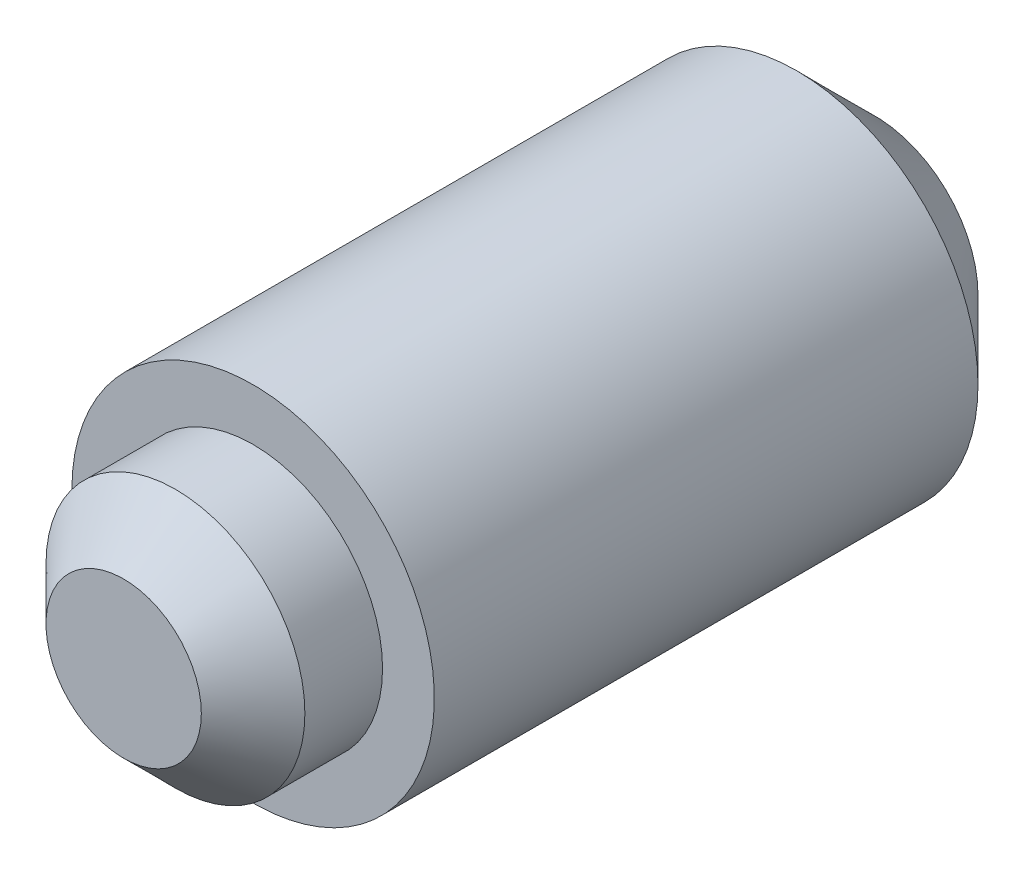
ISO-10303-21;
HEADER;
FILE_DESCRIPTION(('STEP AP214'),'2;1');
FILE_NAME('part.step','',(''),(''),'','','');
FILE_SCHEMA(('AUTOMOTIVE_DESIGN { 1 0 10303 214 1 1 1 1 }'));
ENDSEC;
DATA;
#1=APPLICATION_CONTEXT('core data for automotive mechanical design processes');
#2=APPLICATION_PROTOCOL_DEFINITION('international standard','automotive_design',2000,#1);
#3=PRODUCT_CONTEXT('',#1,'mechanical');
#4=PRODUCT('Part','Part','',(#3));
#5=PRODUCT_RELATED_PRODUCT_CATEGORY('part','',(#4));
#6=PRODUCT_DEFINITION_FORMATION('','',#4);
#7=PRODUCT_DEFINITION_CONTEXT('part definition',#1,'design');
#8=PRODUCT_DEFINITION('design','',#6,#7);
#9=PRODUCT_DEFINITION_SHAPE('','',#8);
#10=(LENGTH_UNIT() NAMED_UNIT(*) SI_UNIT(.MILLI.,.METRE.));
#11=(NAMED_UNIT(*) PLANE_ANGLE_UNIT() SI_UNIT($,.RADIAN.));
#12=(NAMED_UNIT(*) SI_UNIT($,.STERADIAN.) SOLID_ANGLE_UNIT());
#13=UNCERTAINTY_MEASURE_WITH_UNIT(LENGTH_MEASURE(1.E-05),#10,'distance_accuracy_value','');
#14=(GEOMETRIC_REPRESENTATION_CONTEXT(3) GLOBAL_UNCERTAINTY_ASSIGNED_CONTEXT((#13)) GLOBAL_UNIT_ASSIGNED_CONTEXT((#10,
#11,#12)) REPRESENTATION_CONTEXT('',''));
#15=CARTESIAN_POINT('',(0.,0.,0.));
#16=DIRECTION('',(0.,0.,1.));
#17=DIRECTION('',(1.,0.,0.));
#18=AXIS2_PLACEMENT_3D('',#15,#16,#17);
#19=CARTESIAN_POINT('',(0.,0.,14.5));
#20=DIRECTION('',(0.,0.,-1.));
#21=DIRECTION('',(-1.,0.,0.));
#22=AXIS2_PLACEMENT_3D('',#19,#20,#21);
#23=CYLINDRICAL_SURFACE('',#22,7.);
#24=CARTESIAN_POINT('',(0.,0.,-11.5));
#25=DIRECTION('',(0.,0.,1.));
#26=DIRECTION('',(1.,0.,0.));
#27=AXIS2_PLACEMENT_3D('',#24,#25,#26);
#28=CIRCLE('',#27,7.);
#29=CARTESIAN_POINT('',(-7.,0.,-11.5));
#30=VERTEX_POINT('',#29);
#31=EDGE_CURVE('E48',#30,#30,#28,.T.);
#32=CARTESIAN_POINT('',(0.,0.,9.5));
#33=DIRECTION('',(0.,0.,1.));
#34=DIRECTION('',(1.,0.,0.));
#35=AXIS2_PLACEMENT_3D('',#32,#33,#34);
#36=CIRCLE('',#35,7.);
#37=CARTESIAN_POINT('',(-7.,0.,9.5));
#38=VERTEX_POINT('',#37);
#39=EDGE_CURVE('E53',#38,#38,#36,.T.);
#40=CARTESIAN_POINT('',(-7.,0.,-11.5));
#41=CARTESIAN_POINT('',(-7.,0.,-11.28125));
#42=CARTESIAN_POINT('',(-7.,0.,-11.0625));
#43=CARTESIAN_POINT('',(-7.,0.,-10.625));
#44=CARTESIAN_POINT('',(-7.,0.,-10.40625));
#45=CARTESIAN_POINT('',(-7.,0.,-9.96874999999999));
#46=CARTESIAN_POINT('',(-7.,0.,-9.74999999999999));
#47=CARTESIAN_POINT('',(-7.,0.,-9.31249999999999));
#48=CARTESIAN_POINT('',(-7.,0.,-9.09374999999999));
#49=CARTESIAN_POINT('',(-7.,0.,-8.65624999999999));
#50=CARTESIAN_POINT('',(-7.,0.,-8.43749999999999));
#51=CARTESIAN_POINT('',(-7.,0.,-7.99999999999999));
#52=CARTESIAN_POINT('',(-7.,0.,-7.78124999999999));
#53=CARTESIAN_POINT('',(-7.,0.,-7.34374999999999));
#54=CARTESIAN_POINT('',(-7.,0.,-7.12499999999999));
#55=CARTESIAN_POINT('',(-7.,0.,-6.68749999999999));
#56=CARTESIAN_POINT('',(-7.,0.,-6.46874999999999));
#57=CARTESIAN_POINT('',(-7.,0.,-6.03124999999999));
#58=CARTESIAN_POINT('',(-7.,0.,-5.81249999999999));
#59=CARTESIAN_POINT('',(-7.,0.,-5.37499999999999));
#60=CARTESIAN_POINT('',(-7.,0.,-5.15624999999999));
#61=CARTESIAN_POINT('',(-7.,0.,-4.71874999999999));
#62=CARTESIAN_POINT('',(-7.,0.,-4.49999999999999));
#63=CARTESIAN_POINT('',(-7.,0.,-4.06249999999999));
#64=CARTESIAN_POINT('',(-7.,0.,-3.84374999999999));
#65=CARTESIAN_POINT('',(-7.,0.,-3.40624999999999));
#66=CARTESIAN_POINT('',(-7.,0.,-3.18749999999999));
#67=CARTESIAN_POINT('',(-7.,0.,-2.74999999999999));
#68=CARTESIAN_POINT('',(-7.,0.,-2.53124999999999));
#69=CARTESIAN_POINT('',(-7.,0.,-2.09374999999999));
#70=CARTESIAN_POINT('',(-7.,0.,-1.87499999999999));
#71=CARTESIAN_POINT('',(-7.,0.,-1.43749999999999));
#72=CARTESIAN_POINT('',(-7.,0.,-1.21874999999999));
#73=CARTESIAN_POINT('',(-7.,0.,-0.781249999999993));
#74=CARTESIAN_POINT('',(-7.,0.,-0.562499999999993));
#75=CARTESIAN_POINT('',(-7.,0.,-0.124999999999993));
#76=CARTESIAN_POINT('',(-7.,0.,0.093750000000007));
#77=CARTESIAN_POINT('',(-7.,0.,0.531250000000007));
#78=CARTESIAN_POINT('',(-7.,0.,0.750000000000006));
#79=CARTESIAN_POINT('',(-7.,0.,1.18750000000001));
#80=CARTESIAN_POINT('',(-7.,0.,1.40625000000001));
#81=CARTESIAN_POINT('',(-7.,0.,1.84375000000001));
#82=CARTESIAN_POINT('',(-7.,0.,2.06250000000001));
#83=CARTESIAN_POINT('',(-7.,0.,2.50000000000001));
#84=CARTESIAN_POINT('',(-7.,0.,2.71875000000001));
#85=CARTESIAN_POINT('',(-7.,0.,3.15625000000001));
#86=CARTESIAN_POINT('',(-7.,0.,3.37500000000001));
#87=CARTESIAN_POINT('',(-7.,0.,3.8125));
#88=CARTESIAN_POINT('',(-7.,0.,4.03125));
#89=CARTESIAN_POINT('',(-7.,0.,4.46875));
#90=CARTESIAN_POINT('',(-7.,0.,4.6875));
#91=CARTESIAN_POINT('',(-7.,0.,5.125));
#92=CARTESIAN_POINT('',(-7.,0.,5.34375));
#93=CARTESIAN_POINT('',(-7.,0.,5.78125));
#94=CARTESIAN_POINT('',(-7.,0.,6.));
#95=CARTESIAN_POINT('',(-7.,0.,6.4375));
#96=CARTESIAN_POINT('',(-7.,0.,6.65625));
#97=CARTESIAN_POINT('',(-7.,0.,7.09375));
#98=CARTESIAN_POINT('',(-7.,0.,7.3125));
#99=CARTESIAN_POINT('',(-7.,0.,7.75));
#100=CARTESIAN_POINT('',(-7.,0.,7.96875));
#101=CARTESIAN_POINT('',(-7.,0.,8.40625));
#102=CARTESIAN_POINT('',(-7.,0.,8.625));
#103=CARTESIAN_POINT('',(-7.,0.,9.0625));
#104=CARTESIAN_POINT('',(-7.,0.,9.28125));
#105=CARTESIAN_POINT('',(-7.,0.,9.5));
#106=B_SPLINE_CURVE_WITH_KNOTS('',3,(#40,#41,#42,#43,#44,#45,#46,#47,#48,#49,#50,#51,#52,#53,
#54,#55,#56,#57,#58,#59,#60,#61,#62,#63,#64,#65,#66,#67,#68,#69,#70,#71,#72,#73,#74,#75,#76,#77,
#78,#79,#80,#81,#82,#83,#84,#85,#86,#87,#88,#89,#90,#91,#92,#93,#94,#95,#96,#97,#98,#99,#100,
#101,#102,#103,#104,#105),.UNSPECIFIED.,.F.,.F.,(4,2,2,2,2,2,2,2,2,2,2,2,2,2,2,2,2,2,2,2,2,2,2,
2,2,2,2,2,2,2,2,2,4),(0.,0.656250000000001,1.3125,1.96875,2.625,3.28125,3.9375,4.59375,5.25,
5.90624999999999,6.5625,7.21875,7.87499999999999,8.53125,9.18749999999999,9.84374999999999,10.5,
11.15625,11.8125,12.46875,13.125,13.78125,14.4375,15.09375,15.75,16.40625,17.0625,17.71875,
18.375,19.03125,19.6875,20.34375,21.),.UNSPECIFIED.);
#107=EDGE_CURVE('BSEAM33',#30,#38,#106,.T.);
#108=ORIENTED_EDGE('',*,*,#31,.T.);
#109=ORIENTED_EDGE('',*,*,#39,.F.);
#110=ORIENTED_EDGE('',*,*,#107,.T.);
#111=ORIENTED_EDGE('',*,*,#107,.F.);
#112=EDGE_LOOP('',(#108,#110,#109,#111));
#113=FACE_BOUND('',#112,.T.);
#114=ADVANCED_FACE('F33',(#113),#23,.T.);
#115=CARTESIAN_POINT('',(0.,0.,-14.5));
#116=DIRECTION('',(0.,0.,1.));
#117=DIRECTION('',(1.,0.,0.));
#118=AXIS2_PLACEMENT_3D('',#115,#116,#117);
#119=PLANE('',#118);
#120=CARTESIAN_POINT('',(0.,0.,-14.5));
#121=DIRECTION('',(0.,0.,1.));
#122=DIRECTION('',(1.,0.,0.));
#123=AXIS2_PLACEMENT_3D('',#120,#121,#122);
#124=CIRCLE('',#123,3.99999999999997);
#125=CARTESIAN_POINT('',(3.99999999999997,0.,-14.5));
#126=VERTEX_POINT('',#125);
#127=EDGE_CURVE('E44',#126,#126,#124,.F.);
#128=ORIENTED_EDGE('',*,*,#127,.T.);
#129=EDGE_LOOP('',(#128));
#130=FACE_BOUND('',#129,.T.);
#131=ADVANCED_FACE('F65',(#130),#119,.F.);
#132=CARTESIAN_POINT('',(0.,0.,9.5));
#133=DIRECTION('',(0.,0.,1.));
#134=DIRECTION('',(1.,0.,0.));
#135=AXIS2_PLACEMENT_3D('',#132,#133,#134);
#136=PLANE('',#135);
#137=CARTESIAN_POINT('',(0.,0.,9.5));
#138=DIRECTION('',(0.,0.,1.));
#139=DIRECTION('',(1.,0.,0.));
#140=AXIS2_PLACEMENT_3D('',#137,#138,#139);
#141=CIRCLE('',#140,5.);
#142=CARTESIAN_POINT('',(5.,0.,9.5));
#143=VERTEX_POINT('',#142);
#144=EDGE_CURVE('E56',#143,#143,#141,.T.);
#145=ORIENTED_EDGE('',*,*,#144,.F.);
#146=EDGE_LOOP('',(#145));
#147=FACE_BOUND('',#146,.T.);
#148=ORIENTED_EDGE('',*,*,#39,.T.);
#149=EDGE_LOOP('',(#148));
#150=FACE_BOUND('',#149,.T.);
#151=ADVANCED_FACE('F62',(#147,#150),#136,.T.);
#152=CARTESIAN_POINT('',(0.,0.,9.5));
#153=DIRECTION('',(0.,0.,1.));
#154=DIRECTION('',(1.,0.,0.));
#155=AXIS2_PLACEMENT_3D('',#152,#153,#154);
#156=CYLINDRICAL_SURFACE('',#155,5.);
#157=CARTESIAN_POINT('',(0.,0.,12.5));
#158=DIRECTION('',(0.,0.,1.));
#159=DIRECTION('',(1.,0.,0.));
#160=AXIS2_PLACEMENT_3D('',#157,#158,#159);
#161=CIRCLE('',#160,5.);
#162=CARTESIAN_POINT('',(5.,0.,12.5));
#163=VERTEX_POINT('',#162);
#164=EDGE_CURVE('E11',#163,#163,#161,.F.);
#165=ORIENTED_EDGE('',*,*,#164,.T.);
#166=EDGE_LOOP('',(#165));
#167=FACE_BOUND('',#166,.T.);
#168=ORIENTED_EDGE('',*,*,#144,.T.);
#169=EDGE_LOOP('',(#168));
#170=FACE_BOUND('',#169,.T.);
#171=ADVANCED_FACE('F60',(#167,#170),#156,.T.);
#172=CARTESIAN_POINT('',(0.,0.,14.5));
#173=DIRECTION('',(0.,0.,1.));
#174=DIRECTION('',(1.,0.,0.));
#175=AXIS2_PLACEMENT_3D('',#172,#173,#174);
#176=PLANE('',#175);
#177=CARTESIAN_POINT('',(0.,0.,14.5));
#178=DIRECTION('',(0.,0.,1.));
#179=DIRECTION('',(1.,0.,0.));
#180=AXIS2_PLACEMENT_3D('',#177,#178,#179);
#181=CIRCLE('',#180,3.);
#182=CARTESIAN_POINT('',(3.,0.,14.5));
#183=VERTEX_POINT('',#182);
#184=EDGE_CURVE('E40',#183,#183,#181,.T.);
#185=ORIENTED_EDGE('',*,*,#184,.T.);
#186=EDGE_LOOP('',(#185));
#187=FACE_BOUND('',#186,.T.);
#188=ADVANCED_FACE('F80',(#187),#176,.T.);
#189=CARTESIAN_POINT('',(0.,0.,-11.5));
#190=DIRECTION('',(0.,0.,1.));
#191=DIRECTION('',(1.,0.,0.));
#192=AXIS2_PLACEMENT_3D('',#189,#190,#191);
#193=CONICAL_SURFACE('',#192,7.,0.78539816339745);
#194=ORIENTED_EDGE('',*,*,#127,.F.);
#195=EDGE_LOOP('',(#194));
#196=FACE_BOUND('',#195,.T.);
#197=ORIENTED_EDGE('',*,*,#31,.F.);
#198=EDGE_LOOP('',(#197));
#199=FACE_BOUND('',#198,.T.);
#200=ADVANCED_FACE('F78',(#196,#199),#193,.T.);
#201=CARTESIAN_POINT('',(0.,0.,14.5));
#202=DIRECTION('',(0.,0.,-1.));
#203=DIRECTION('',(-1.,0.,0.));
#204=AXIS2_PLACEMENT_3D('',#201,#202,#203);
#205=CONICAL_SURFACE('',#204,3.,0.785398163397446);
#206=ORIENTED_EDGE('',*,*,#164,.F.);
#207=EDGE_LOOP('',(#206));
#208=FACE_BOUND('',#207,.T.);
#209=ORIENTED_EDGE('',*,*,#184,.F.);
#210=EDGE_LOOP('',(#209));
#211=FACE_BOUND('',#210,.T.);
#212=ADVANCED_FACE('F35',(#208,#211),#205,.T.);
#213=CLOSED_SHELL('',(#114,#131,#151,#171,#188,#200,#212));
#214=MANIFOLD_SOLID_BREP('B2',#213);
#215=ADVANCED_BREP_SHAPE_REPRESENTATION('',(#18,#214),#14);
#216=SHAPE_DEFINITION_REPRESENTATION(#9,#215);
ENDSEC;
END-ISO-10303-21;
